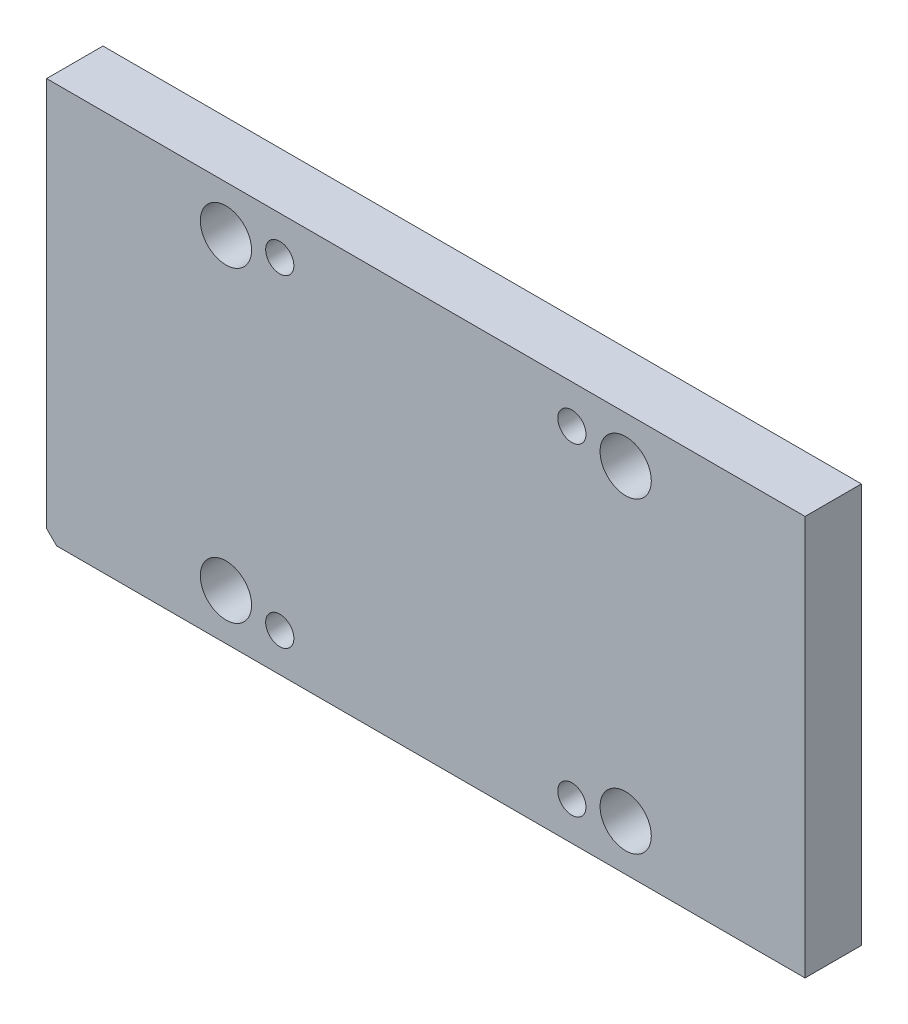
ISO-10303-21;
HEADER;
FILE_DESCRIPTION(('STEP AP214'),'2;1');
FILE_NAME('part.step','',(''),(''),'','','');
FILE_SCHEMA(('AUTOMOTIVE_DESIGN { 1 0 10303 214 1 1 1 1 }'));
ENDSEC;
DATA;
#1=APPLICATION_CONTEXT('core data for automotive mechanical design processes');
#2=APPLICATION_PROTOCOL_DEFINITION('international standard','automotive_design',2000,#1);
#3=PRODUCT_CONTEXT('',#1,'mechanical');
#4=PRODUCT('Part','Part','',(#3));
#5=PRODUCT_RELATED_PRODUCT_CATEGORY('part','',(#4));
#6=PRODUCT_DEFINITION_FORMATION('','',#4);
#7=PRODUCT_DEFINITION_CONTEXT('part definition',#1,'design');
#8=PRODUCT_DEFINITION('design','',#6,#7);
#9=PRODUCT_DEFINITION_SHAPE('','',#8);
#10=(LENGTH_UNIT() NAMED_UNIT(*) SI_UNIT(.MILLI.,.METRE.));
#11=(NAMED_UNIT(*) PLANE_ANGLE_UNIT() SI_UNIT($,.RADIAN.));
#12=(NAMED_UNIT(*) SI_UNIT($,.STERADIAN.) SOLID_ANGLE_UNIT());
#13=UNCERTAINTY_MEASURE_WITH_UNIT(LENGTH_MEASURE(1.E-05),#10,'distance_accuracy_value','');
#14=(GEOMETRIC_REPRESENTATION_CONTEXT(3) GLOBAL_UNCERTAINTY_ASSIGNED_CONTEXT((#13)) GLOBAL_UNIT_ASSIGNED_CONTEXT((#10,
#11,#12)) REPRESENTATION_CONTEXT('',''));
#15=CARTESIAN_POINT('',(0.,0.,0.));
#16=DIRECTION('',(0.,0.,1.));
#17=DIRECTION('',(1.,0.,0.));
#18=AXIS2_PLACEMENT_3D('',#15,#16,#17);
#19=CARTESIAN_POINT('',(-148.,-78.,-356.592289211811));
#20=DIRECTION('',(-1.,0.,0.));
#21=DIRECTION('',(0.,0.,1.));
#22=AXIS2_PLACEMENT_3D('',#19,#20,#21);
#23=PLANE('',#22);
#24=DIRECTION('',(0.,1.,0.));
#25=VECTOR('',#24,1.);
#26=CARTESIAN_POINT('',(-148.,-78.,-22.));
#27=LINE('',#26,#25);
#28=CARTESIAN_POINT('',(-148.,-74.08,-22.));
#29=VERTEX_POINT('',#28);
#30=CARTESIAN_POINT('',(-148.,78.,-22.));
#31=VERTEX_POINT('',#30);
#32=EDGE_CURVE('E108',#29,#31,#27,.T.);
#33=ORIENTED_EDGE('',*,*,#32,.F.);
#34=DIRECTION('',(0.,0.,1.));
#35=VECTOR('',#34,1.);
#36=CARTESIAN_POINT('',(-148.,-74.08,-356.592289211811));
#37=LINE('',#36,#35);
#38=CARTESIAN_POINT('',(-148.,-74.08,0.));
#39=VERTEX_POINT('',#38);
#40=EDGE_CURVE('E107',#29,#39,#37,.T.);
#41=ORIENTED_EDGE('',*,*,#40,.T.);
#42=DIRECTION('',(0.,-1.,0.));
#43=VECTOR('',#42,1.);
#44=CARTESIAN_POINT('',(-148.,-78.,0.));
#45=LINE('',#44,#43);
#46=CARTESIAN_POINT('',(-148.,78.,0.));
#47=VERTEX_POINT('',#46);
#48=EDGE_CURVE('E85',#47,#39,#45,.T.);
#49=ORIENTED_EDGE('',*,*,#48,.F.);
#50=DIRECTION('',(0.,0.,1.));
#51=VECTOR('',#50,1.);
#52=CARTESIAN_POINT('',(-148.,78.,-356.592289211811));
#53=LINE('',#52,#51);
#54=EDGE_CURVE('E102',#31,#47,#53,.T.);
#55=ORIENTED_EDGE('',*,*,#54,.F.);
#56=EDGE_LOOP('',(#33,#41,#49,#55));
#57=FACE_BOUND('',#56,.T.);
#58=ADVANCED_FACE('F34',(#57),#23,.T.);
#59=CARTESIAN_POINT('',(-148.,78.,-356.592289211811));
#60=DIRECTION('',(0.,1.,0.));
#61=DIRECTION('',(0.,0.,1.));
#62=AXIS2_PLACEMENT_3D('',#59,#60,#61);
#63=PLANE('',#62);
#64=DIRECTION('',(1.,0.,0.));
#65=VECTOR('',#64,1.);
#66=CARTESIAN_POINT('',(-148.,78.,-22.));
#67=LINE('',#66,#65);
#68=CARTESIAN_POINT('',(148.,78.,-22.));
#69=VERTEX_POINT('',#68);
#70=EDGE_CURVE('E124',#31,#69,#67,.T.);
#71=ORIENTED_EDGE('',*,*,#70,.F.);
#72=ORIENTED_EDGE('',*,*,#54,.T.);
#73=DIRECTION('',(-1.,0.,0.));
#74=VECTOR('',#73,1.);
#75=CARTESIAN_POINT('',(-148.,78.,0.));
#76=LINE('',#75,#74);
#77=CARTESIAN_POINT('',(148.,78.,0.));
#78=VERTEX_POINT('',#77);
#79=EDGE_CURVE('E94',#78,#47,#76,.T.);
#80=ORIENTED_EDGE('',*,*,#79,.F.);
#81=DIRECTION('',(0.,0.,1.));
#82=VECTOR('',#81,1.);
#83=CARTESIAN_POINT('',(148.,78.,-356.592289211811));
#84=LINE('',#83,#82);
#85=EDGE_CURVE('E93',#69,#78,#84,.T.);
#86=ORIENTED_EDGE('',*,*,#85,.F.);
#87=EDGE_LOOP('',(#71,#72,#80,#86));
#88=FACE_BOUND('',#87,.T.);
#89=ADVANCED_FACE('F215',(#88),#63,.T.);
#90=CARTESIAN_POINT('',(148.,-78.,-356.592289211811));
#91=DIRECTION('',(1.,0.,0.));
#92=DIRECTION('',(0.,1.,0.));
#93=AXIS2_PLACEMENT_3D('',#90,#91,#92);
#94=PLANE('',#93);
#95=DIRECTION('',(0.,-1.,0.));
#96=VECTOR('',#95,1.);
#97=CARTESIAN_POINT('',(148.,-78.,-22.));
#98=LINE('',#97,#96);
#99=CARTESIAN_POINT('',(148.,-78.,-22.0000000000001));
#100=VERTEX_POINT('',#99);
#101=EDGE_CURVE('E104',#69,#100,#98,.T.);
#102=ORIENTED_EDGE('',*,*,#101,.F.);
#103=ORIENTED_EDGE('',*,*,#85,.T.);
#104=DIRECTION('',(0.,1.,0.));
#105=VECTOR('',#104,1.);
#106=CARTESIAN_POINT('',(148.,-78.,0.));
#107=LINE('',#106,#105);
#108=CARTESIAN_POINT('',(148.,-78.,0.));
#109=VERTEX_POINT('',#108);
#110=EDGE_CURVE('E83',#109,#78,#107,.T.);
#111=ORIENTED_EDGE('',*,*,#110,.F.);
#112=DIRECTION('',(0.,0.,1.));
#113=VECTOR('',#112,1.);
#114=CARTESIAN_POINT('',(148.,-78.,-356.592289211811));
#115=LINE('',#114,#113);
#116=EDGE_CURVE('E88',#100,#109,#115,.T.);
#117=ORIENTED_EDGE('',*,*,#116,.F.);
#118=EDGE_LOOP('',(#102,#103,#111,#117));
#119=FACE_BOUND('',#118,.T.);
#120=ADVANCED_FACE('F96',(#119),#94,.T.);
#121=CARTESIAN_POINT('',(-148.,-78.,-356.592289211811));
#122=DIRECTION('',(0.,-1.,0.));
#123=DIRECTION('',(1.,0.,0.));
#124=AXIS2_PLACEMENT_3D('',#121,#122,#123);
#125=PLANE('',#124);
#126=DIRECTION('',(1.,0.,0.));
#127=VECTOR('',#126,1.);
#128=CARTESIAN_POINT('',(-148.,-78.,0.));
#129=LINE('',#128,#127);
#130=CARTESIAN_POINT('',(-144.08,-78.,0.));
#131=VERTEX_POINT('',#130);
#132=EDGE_CURVE('E78',#131,#109,#129,.T.);
#133=ORIENTED_EDGE('',*,*,#132,.F.);
#134=DIRECTION('',(0.,0.,-1.));
#135=VECTOR('',#134,1.);
#136=CARTESIAN_POINT('',(-144.08,-78.,-356.592289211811));
#137=LINE('',#136,#135);
#138=CARTESIAN_POINT('',(-144.08,-78.,-22.));
#139=VERTEX_POINT('',#138);
#140=EDGE_CURVE('E42',#131,#139,#137,.T.);
#141=ORIENTED_EDGE('',*,*,#140,.T.);
#142=DIRECTION('',(-1.,0.,0.));
#143=VECTOR('',#142,1.);
#144=CARTESIAN_POINT('',(-148.,-78.,-22.));
#145=LINE('',#144,#143);
#146=EDGE_CURVE('E90',#100,#139,#145,.T.);
#147=ORIENTED_EDGE('',*,*,#146,.F.);
#148=ORIENTED_EDGE('',*,*,#116,.T.);
#149=EDGE_LOOP('',(#133,#141,#147,#148));
#150=FACE_BOUND('',#149,.T.);
#151=ADVANCED_FACE('F89',(#150),#125,.T.);
#152=CARTESIAN_POINT('',(0.,0.,0.));
#153=DIRECTION('',(0.,0.,-1.));
#154=DIRECTION('',(-1.,0.,0.));
#155=AXIS2_PLACEMENT_3D('',#152,#153,#154);
#156=PLANE('',#155);
#157=CARTESIAN_POINT('',(-57.,-63.,0.));
#158=DIRECTION('',(0.,0.,-1.));
#159=DIRECTION('',(-1.,0.,0.));
#160=AXIS2_PLACEMENT_3D('',#157,#158,#159);
#161=CIRCLE('',#160,5.5);
#162=CARTESIAN_POINT('',(-62.5,-63.,0.));
#163=VERTEX_POINT('',#162);
#164=EDGE_CURVE('E183',#163,#163,#161,.T.);
#165=ORIENTED_EDGE('',*,*,#164,.T.);
#166=EDGE_LOOP('',(#165));
#167=FACE_BOUND('',#166,.T.);
#168=CARTESIAN_POINT('',(-57.,63.,0.));
#169=DIRECTION('',(0.,0.,-1.));
#170=DIRECTION('',(-1.,0.,0.));
#171=AXIS2_PLACEMENT_3D('',#168,#169,#170);
#172=CIRCLE('',#171,5.5);
#173=CARTESIAN_POINT('',(-62.5,63.,0.));
#174=VERTEX_POINT('',#173);
#175=EDGE_CURVE('E171',#174,#174,#172,.T.);
#176=ORIENTED_EDGE('',*,*,#175,.T.);
#177=EDGE_LOOP('',(#176));
#178=FACE_BOUND('',#177,.T.);
#179=CARTESIAN_POINT('',(57.,63.,0.));
#180=DIRECTION('',(0.,0.,-1.));
#181=DIRECTION('',(-1.,0.,0.));
#182=AXIS2_PLACEMENT_3D('',#179,#180,#181);
#183=CIRCLE('',#182,5.50000000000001);
#184=CARTESIAN_POINT('',(51.5,63.,0.));
#185=VERTEX_POINT('',#184);
#186=EDGE_CURVE('E159',#185,#185,#183,.T.);
#187=ORIENTED_EDGE('',*,*,#186,.T.);
#188=EDGE_LOOP('',(#187));
#189=FACE_BOUND('',#188,.T.);
#190=CARTESIAN_POINT('',(57.0000000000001,-63.,0.));
#191=DIRECTION('',(0.,0.,-1.));
#192=DIRECTION('',(-1.,0.,0.));
#193=AXIS2_PLACEMENT_3D('',#190,#191,#192);
#194=CIRCLE('',#193,5.50000000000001);
#195=CARTESIAN_POINT('',(51.5000000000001,-63.,0.));
#196=VERTEX_POINT('',#195);
#197=EDGE_CURVE('E147',#196,#196,#194,.T.);
#198=ORIENTED_EDGE('',*,*,#197,.T.);
#199=EDGE_LOOP('',(#198));
#200=FACE_BOUND('',#199,.T.);
#201=CARTESIAN_POINT('',(-78.,-60.,0.));
#202=DIRECTION('',(0.,0.,1.));
#203=DIRECTION('',(1.,0.,0.));
#204=AXIS2_PLACEMENT_3D('',#201,#202,#203);
#205=CIRCLE('',#204,9.99999999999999);
#206=CARTESIAN_POINT('',(-68.,-60.,0.));
#207=VERTEX_POINT('',#206);
#208=EDGE_CURVE('E144',#207,#207,#205,.T.);
#209=ORIENTED_EDGE('',*,*,#208,.F.);
#210=EDGE_LOOP('',(#209));
#211=FACE_BOUND('',#210,.T.);
#212=CARTESIAN_POINT('',(-78.,60.,0.));
#213=DIRECTION('',(0.,0.,1.));
#214=DIRECTION('',(1.,0.,0.));
#215=AXIS2_PLACEMENT_3D('',#212,#213,#214);
#216=CIRCLE('',#215,9.99999999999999);
#217=CARTESIAN_POINT('',(-68.,60.,0.));
#218=VERTEX_POINT('',#217);
#219=EDGE_CURVE('E138',#218,#218,#216,.T.);
#220=ORIENTED_EDGE('',*,*,#219,.F.);
#221=EDGE_LOOP('',(#220));
#222=FACE_BOUND('',#221,.T.);
#223=CARTESIAN_POINT('',(78.,60.,0.));
#224=DIRECTION('',(0.,0.,1.));
#225=DIRECTION('',(1.,0.,0.));
#226=AXIS2_PLACEMENT_3D('',#223,#224,#225);
#227=CIRCLE('',#226,9.99999999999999);
#228=CARTESIAN_POINT('',(88.,60.,0.));
#229=VERTEX_POINT('',#228);
#230=EDGE_CURVE('E132',#229,#229,#227,.T.);
#231=ORIENTED_EDGE('',*,*,#230,.F.);
#232=EDGE_LOOP('',(#231));
#233=FACE_BOUND('',#232,.T.);
#234=CARTESIAN_POINT('',(78.,-60.,0.));
#235=DIRECTION('',(0.,0.,1.));
#236=DIRECTION('',(1.,0.,0.));
#237=AXIS2_PLACEMENT_3D('',#234,#235,#236);
#238=CIRCLE('',#237,9.99999999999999);
#239=CARTESIAN_POINT('',(88.,-60.,0.));
#240=VERTEX_POINT('',#239);
#241=EDGE_CURVE('E120',#240,#240,#238,.T.);
#242=ORIENTED_EDGE('',*,*,#241,.F.);
#243=EDGE_LOOP('',(#242));
#244=FACE_BOUND('',#243,.T.);
#245=ORIENTED_EDGE('',*,*,#48,.T.);
#246=DIRECTION('',(-0.70710678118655,0.707106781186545,0.));
#247=VECTOR('',#246,1.);
#248=CARTESIAN_POINT('',(-148.,-74.08,0.));
#249=LINE('',#248,#247);
#250=EDGE_CURVE('E56',#39,#131,#249,.F.);
#251=ORIENTED_EDGE('',*,*,#250,.T.);
#252=ORIENTED_EDGE('',*,*,#132,.T.);
#253=ORIENTED_EDGE('',*,*,#110,.T.);
#254=ORIENTED_EDGE('',*,*,#79,.T.);
#255=EDGE_LOOP('',(#245,#251,#252,#253,#254));
#256=FACE_BOUND('',#255,.T.);
#257=ADVANCED_FACE('F80',(#167,#178,#189,#200,#211,#222,#233,#244,#256),#156,.F.);
#258=CARTESIAN_POINT('',(0.,0.,-22.));
#259=DIRECTION('',(0.,0.,1.));
#260=DIRECTION('',(1.,0.,0.));
#261=AXIS2_PLACEMENT_3D('',#258,#259,#260);
#262=PLANE('',#261);
#263=CARTESIAN_POINT('',(0.,0.,-22.));
#264=DIRECTION('',(0.,0.,1.));
#265=DIRECTION('',(1.,0.,0.));
#266=AXIS2_PLACEMENT_3D('',#263,#264,#265);
#267=CIRCLE('',#266,45.);
#268=CARTESIAN_POINT('',(45.,0.,-22.));
#269=VERTEX_POINT('',#268);
#270=EDGE_CURVE('E196',#269,#269,#267,.T.);
#271=ORIENTED_EDGE('',*,*,#270,.T.);
#272=EDGE_LOOP('',(#271));
#273=FACE_BOUND('',#272,.T.);
#274=CARTESIAN_POINT('',(-57.,-63.,-22.));
#275=DIRECTION('',(0.,0.,-1.));
#276=DIRECTION('',(-1.,0.,0.));
#277=AXIS2_PLACEMENT_3D('',#274,#275,#276);
#278=CIRCLE('',#277,9.);
#279=CARTESIAN_POINT('',(-66.,-63.,-22.));
#280=VERTEX_POINT('',#279);
#281=EDGE_CURVE('E192',#280,#280,#278,.T.);
#282=ORIENTED_EDGE('',*,*,#281,.F.);
#283=EDGE_LOOP('',(#282));
#284=FACE_BOUND('',#283,.T.);
#285=CARTESIAN_POINT('',(-57.,63.,-22.));
#286=DIRECTION('',(0.,0.,-1.));
#287=DIRECTION('',(-1.,0.,0.));
#288=AXIS2_PLACEMENT_3D('',#285,#286,#287);
#289=CIRCLE('',#288,9.);
#290=CARTESIAN_POINT('',(-66.,63.,-22.));
#291=VERTEX_POINT('',#290);
#292=EDGE_CURVE('E180',#291,#291,#289,.T.);
#293=ORIENTED_EDGE('',*,*,#292,.F.);
#294=EDGE_LOOP('',(#293));
#295=FACE_BOUND('',#294,.T.);
#296=CARTESIAN_POINT('',(57.,63.,-22.));
#297=DIRECTION('',(0.,0.,-1.));
#298=DIRECTION('',(-1.,0.,0.));
#299=AXIS2_PLACEMENT_3D('',#296,#297,#298);
#300=CIRCLE('',#299,9.00000000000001);
#301=CARTESIAN_POINT('',(48.,63.,-22.));
#302=VERTEX_POINT('',#301);
#303=EDGE_CURVE('E168',#302,#302,#300,.T.);
#304=ORIENTED_EDGE('',*,*,#303,.F.);
#305=EDGE_LOOP('',(#304));
#306=FACE_BOUND('',#305,.T.);
#307=CARTESIAN_POINT('',(57.0000000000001,-63.,-22.));
#308=DIRECTION('',(0.,0.,-1.));
#309=DIRECTION('',(-1.,0.,0.));
#310=AXIS2_PLACEMENT_3D('',#307,#308,#309);
#311=CIRCLE('',#310,9.00000000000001);
#312=CARTESIAN_POINT('',(48.0000000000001,-63.,-22.));
#313=VERTEX_POINT('',#312);
#314=EDGE_CURVE('E156',#313,#313,#311,.T.);
#315=ORIENTED_EDGE('',*,*,#314,.F.);
#316=EDGE_LOOP('',(#315));
#317=FACE_BOUND('',#316,.T.);
#318=CARTESIAN_POINT('',(-78.,-60.,-22.));
#319=DIRECTION('',(0.,0.,1.));
#320=DIRECTION('',(1.,0.,0.));
#321=AXIS2_PLACEMENT_3D('',#318,#319,#320);
#322=CIRCLE('',#321,9.99999999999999);
#323=CARTESIAN_POINT('',(-68.,-60.,-22.));
#324=VERTEX_POINT('',#323);
#325=EDGE_CURVE('E141',#324,#324,#322,.T.);
#326=ORIENTED_EDGE('',*,*,#325,.T.);
#327=EDGE_LOOP('',(#326));
#328=FACE_BOUND('',#327,.T.);
#329=CARTESIAN_POINT('',(-78.,60.,-22.));
#330=DIRECTION('',(0.,0.,1.));
#331=DIRECTION('',(1.,0.,0.));
#332=AXIS2_PLACEMENT_3D('',#329,#330,#331);
#333=CIRCLE('',#332,9.99999999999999);
#334=CARTESIAN_POINT('',(-68.,60.,-22.));
#335=VERTEX_POINT('',#334);
#336=EDGE_CURVE('E135',#335,#335,#333,.T.);
#337=ORIENTED_EDGE('',*,*,#336,.T.);
#338=EDGE_LOOP('',(#337));
#339=FACE_BOUND('',#338,.T.);
#340=CARTESIAN_POINT('',(78.,60.,-22.));
#341=DIRECTION('',(0.,0.,1.));
#342=DIRECTION('',(1.,0.,0.));
#343=AXIS2_PLACEMENT_3D('',#340,#341,#342);
#344=CIRCLE('',#343,9.99999999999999);
#345=CARTESIAN_POINT('',(88.,60.,-22.));
#346=VERTEX_POINT('',#345);
#347=EDGE_CURVE('E129',#346,#346,#344,.T.);
#348=ORIENTED_EDGE('',*,*,#347,.T.);
#349=EDGE_LOOP('',(#348));
#350=FACE_BOUND('',#349,.T.);
#351=CARTESIAN_POINT('',(78.,-60.,-22.));
#352=DIRECTION('',(0.,0.,1.));
#353=DIRECTION('',(1.,0.,0.));
#354=AXIS2_PLACEMENT_3D('',#351,#352,#353);
#355=CIRCLE('',#354,9.99999999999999);
#356=CARTESIAN_POINT('',(88.,-60.,-22.));
#357=VERTEX_POINT('',#356);
#358=EDGE_CURVE('E118',#357,#357,#355,.T.);
#359=ORIENTED_EDGE('',*,*,#358,.T.);
#360=EDGE_LOOP('',(#359));
#361=FACE_BOUND('',#360,.T.);
#362=ORIENTED_EDGE('',*,*,#146,.T.);
#363=DIRECTION('',(0.70710678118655,-0.707106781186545,0.));
#364=VECTOR('',#363,1.);
#365=CARTESIAN_POINT('',(-148.,-74.08,-22.));
#366=LINE('',#365,#364);
#367=EDGE_CURVE('E11',#139,#29,#366,.F.);
#368=ORIENTED_EDGE('',*,*,#367,.T.);
#369=ORIENTED_EDGE('',*,*,#32,.T.);
#370=ORIENTED_EDGE('',*,*,#70,.T.);
#371=ORIENTED_EDGE('',*,*,#101,.T.);
#372=EDGE_LOOP('',(#362,#368,#369,#370,#371));
#373=FACE_BOUND('',#372,.T.);
#374=ADVANCED_FACE('F228',(#273,#284,#295,#306,#317,#328,#339,#350,#361,#373),#262,.F.);
#375=CARTESIAN_POINT('',(78.,-60.,0.));
#376=DIRECTION('',(0.,0.,1.));
#377=DIRECTION('',(1.,0.,0.));
#378=AXIS2_PLACEMENT_3D('',#375,#376,#377);
#379=CYLINDRICAL_SURFACE('',#378,9.99999999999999);
#380=ORIENTED_EDGE('',*,*,#358,.F.);
#381=EDGE_LOOP('',(#380));
#382=FACE_BOUND('',#381,.T.);
#383=ORIENTED_EDGE('',*,*,#241,.T.);
#384=EDGE_LOOP('',(#383));
#385=FACE_BOUND('',#384,.T.);
#386=ADVANCED_FACE('F232',(#382,#385),#379,.F.);
#387=CARTESIAN_POINT('',(78.,60.,0.));
#388=DIRECTION('',(0.,0.,1.));
#389=DIRECTION('',(1.,0.,0.));
#390=AXIS2_PLACEMENT_3D('',#387,#388,#389);
#391=CYLINDRICAL_SURFACE('',#390,9.99999999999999);
#392=ORIENTED_EDGE('',*,*,#347,.F.);
#393=EDGE_LOOP('',(#392));
#394=FACE_BOUND('',#393,.T.);
#395=ORIENTED_EDGE('',*,*,#230,.T.);
#396=EDGE_LOOP('',(#395));
#397=FACE_BOUND('',#396,.T.);
#398=ADVANCED_FACE('F236',(#394,#397),#391,.F.);
#399=CARTESIAN_POINT('',(-78.,60.,0.));
#400=DIRECTION('',(0.,0.,1.));
#401=DIRECTION('',(1.,0.,0.));
#402=AXIS2_PLACEMENT_3D('',#399,#400,#401);
#403=CYLINDRICAL_SURFACE('',#402,9.99999999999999);
#404=ORIENTED_EDGE('',*,*,#336,.F.);
#405=EDGE_LOOP('',(#404));
#406=FACE_BOUND('',#405,.T.);
#407=ORIENTED_EDGE('',*,*,#219,.T.);
#408=EDGE_LOOP('',(#407));
#409=FACE_BOUND('',#408,.T.);
#410=ADVANCED_FACE('F240',(#406,#409),#403,.F.);
#411=CARTESIAN_POINT('',(-78.,-60.,0.));
#412=DIRECTION('',(0.,0.,1.));
#413=DIRECTION('',(1.,0.,0.));
#414=AXIS2_PLACEMENT_3D('',#411,#412,#413);
#415=CYLINDRICAL_SURFACE('',#414,9.99999999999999);
#416=ORIENTED_EDGE('',*,*,#325,.F.);
#417=EDGE_LOOP('',(#416));
#418=FACE_BOUND('',#417,.T.);
#419=ORIENTED_EDGE('',*,*,#208,.T.);
#420=EDGE_LOOP('',(#419));
#421=FACE_BOUND('',#420,.T.);
#422=ADVANCED_FACE('F244',(#418,#421),#415,.F.);
#423=CARTESIAN_POINT('',(57.0000000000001,-63.,-22.));
#424=DIRECTION('',(0.,0.,-1.));
#425=DIRECTION('',(-1.,0.,0.));
#426=AXIS2_PLACEMENT_3D('',#423,#424,#425);
#427=CYLINDRICAL_SURFACE('',#426,5.50000000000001);
#428=ORIENTED_EDGE('',*,*,#197,.F.);
#429=EDGE_LOOP('',(#428));
#430=FACE_BOUND('',#429,.T.);
#431=CARTESIAN_POINT('',(57.0000000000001,-63.,-9.));
#432=DIRECTION('',(0.,0.,-1.));
#433=DIRECTION('',(-1.,0.,0.));
#434=AXIS2_PLACEMENT_3D('',#431,#432,#433);
#435=CIRCLE('',#434,5.50000000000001);
#436=CARTESIAN_POINT('',(51.5000000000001,-63.,-9.));
#437=VERTEX_POINT('',#436);
#438=EDGE_CURVE('E150',#437,#437,#435,.T.);
#439=ORIENTED_EDGE('',*,*,#438,.T.);
#440=EDGE_LOOP('',(#439));
#441=FACE_BOUND('',#440,.T.);
#442=ADVANCED_FACE('F248',(#430,#441),#427,.F.);
#443=CARTESIAN_POINT('',(62.5000000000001,-63.,-9.));
#444=DIRECTION('',(0.,0.,1.));
#445=DIRECTION('',(1.,0.,0.));
#446=AXIS2_PLACEMENT_3D('',#443,#444,#445);
#447=PLANE('',#446);
#448=ORIENTED_EDGE('',*,*,#438,.F.);
#449=EDGE_LOOP('',(#448));
#450=FACE_BOUND('',#449,.T.);
#451=CARTESIAN_POINT('',(57.0000000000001,-63.,-9.));
#452=DIRECTION('',(0.,0.,-1.));
#453=DIRECTION('',(-1.,0.,0.));
#454=AXIS2_PLACEMENT_3D('',#451,#452,#453);
#455=CIRCLE('',#454,8.99999999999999);
#456=CARTESIAN_POINT('',(48.0000000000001,-63.,-9.));
#457=VERTEX_POINT('',#456);
#458=EDGE_CURVE('E153',#457,#457,#455,.T.);
#459=ORIENTED_EDGE('',*,*,#458,.T.);
#460=EDGE_LOOP('',(#459));
#461=FACE_BOUND('',#460,.T.);
#462=ADVANCED_FACE('F252',(#450,#461),#447,.F.);
#463=CARTESIAN_POINT('',(57.0000000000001,-63.,-22.));
#464=DIRECTION('',(0.,0.,-1.));
#465=DIRECTION('',(-1.,0.,0.));
#466=AXIS2_PLACEMENT_3D('',#463,#464,#465);
#467=CYLINDRICAL_SURFACE('',#466,9.);
#468=ORIENTED_EDGE('',*,*,#458,.F.);
#469=EDGE_LOOP('',(#468));
#470=FACE_BOUND('',#469,.T.);
#471=ORIENTED_EDGE('',*,*,#314,.T.);
#472=EDGE_LOOP('',(#471));
#473=FACE_BOUND('',#472,.T.);
#474=ADVANCED_FACE('F256',(#470,#473),#467,.F.);
#475=CARTESIAN_POINT('',(57.,63.,-22.));
#476=DIRECTION('',(0.,0.,-1.));
#477=DIRECTION('',(-1.,0.,0.));
#478=AXIS2_PLACEMENT_3D('',#475,#476,#477);
#479=CYLINDRICAL_SURFACE('',#478,5.50000000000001);
#480=ORIENTED_EDGE('',*,*,#186,.F.);
#481=EDGE_LOOP('',(#480));
#482=FACE_BOUND('',#481,.T.);
#483=CARTESIAN_POINT('',(57.,63.,-9.));
#484=DIRECTION('',(0.,0.,-1.));
#485=DIRECTION('',(-1.,0.,0.));
#486=AXIS2_PLACEMENT_3D('',#483,#484,#485);
#487=CIRCLE('',#486,5.50000000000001);
#488=CARTESIAN_POINT('',(51.5,63.,-9.));
#489=VERTEX_POINT('',#488);
#490=EDGE_CURVE('E162',#489,#489,#487,.T.);
#491=ORIENTED_EDGE('',*,*,#490,.T.);
#492=EDGE_LOOP('',(#491));
#493=FACE_BOUND('',#492,.T.);
#494=ADVANCED_FACE('F260',(#482,#493),#479,.F.);
#495=CARTESIAN_POINT('',(62.5,63.,-9.));
#496=DIRECTION('',(0.,0.,1.));
#497=DIRECTION('',(1.,0.,0.));
#498=AXIS2_PLACEMENT_3D('',#495,#496,#497);
#499=PLANE('',#498);
#500=ORIENTED_EDGE('',*,*,#490,.F.);
#501=EDGE_LOOP('',(#500));
#502=FACE_BOUND('',#501,.T.);
#503=CARTESIAN_POINT('',(57.,63.,-9.));
#504=DIRECTION('',(0.,0.,-1.));
#505=DIRECTION('',(-1.,0.,0.));
#506=AXIS2_PLACEMENT_3D('',#503,#504,#505);
#507=CIRCLE('',#506,9.00000000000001);
#508=CARTESIAN_POINT('',(48.,63.,-9.));
#509=VERTEX_POINT('',#508);
#510=EDGE_CURVE('E165',#509,#509,#507,.T.);
#511=ORIENTED_EDGE('',*,*,#510,.T.);
#512=EDGE_LOOP('',(#511));
#513=FACE_BOUND('',#512,.T.);
#514=ADVANCED_FACE('F264',(#502,#513),#499,.F.);
#515=CARTESIAN_POINT('',(57.,63.,-22.));
#516=DIRECTION('',(0.,0.,-1.));
#517=DIRECTION('',(-1.,0.,0.));
#518=AXIS2_PLACEMENT_3D('',#515,#516,#517);
#519=CYLINDRICAL_SURFACE('',#518,9.00000000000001);
#520=ORIENTED_EDGE('',*,*,#510,.F.);
#521=EDGE_LOOP('',(#520));
#522=FACE_BOUND('',#521,.T.);
#523=ORIENTED_EDGE('',*,*,#303,.T.);
#524=EDGE_LOOP('',(#523));
#525=FACE_BOUND('',#524,.T.);
#526=ADVANCED_FACE('F268',(#522,#525),#519,.F.);
#527=CARTESIAN_POINT('',(-57.,63.,-22.));
#528=DIRECTION('',(0.,0.,-1.));
#529=DIRECTION('',(-1.,0.,0.));
#530=AXIS2_PLACEMENT_3D('',#527,#528,#529);
#531=CYLINDRICAL_SURFACE('',#530,5.5);
#532=ORIENTED_EDGE('',*,*,#175,.F.);
#533=EDGE_LOOP('',(#532));
#534=FACE_BOUND('',#533,.T.);
#535=CARTESIAN_POINT('',(-57.,63.,-9.));
#536=DIRECTION('',(0.,0.,-1.));
#537=DIRECTION('',(-1.,0.,0.));
#538=AXIS2_PLACEMENT_3D('',#535,#536,#537);
#539=CIRCLE('',#538,5.5);
#540=CARTESIAN_POINT('',(-62.5,63.,-9.));
#541=VERTEX_POINT('',#540);
#542=EDGE_CURVE('E174',#541,#541,#539,.T.);
#543=ORIENTED_EDGE('',*,*,#542,.T.);
#544=EDGE_LOOP('',(#543));
#545=FACE_BOUND('',#544,.T.);
#546=ADVANCED_FACE('F272',(#534,#545),#531,.F.);
#547=CARTESIAN_POINT('',(-51.5,63.,-9.));
#548=DIRECTION('',(0.,0.,1.));
#549=DIRECTION('',(1.,0.,0.));
#550=AXIS2_PLACEMENT_3D('',#547,#548,#549);
#551=PLANE('',#550);
#552=ORIENTED_EDGE('',*,*,#542,.F.);
#553=EDGE_LOOP('',(#552));
#554=FACE_BOUND('',#553,.T.);
#555=CARTESIAN_POINT('',(-57.,63.,-9.));
#556=DIRECTION('',(0.,0.,-1.));
#557=DIRECTION('',(-1.,0.,0.));
#558=AXIS2_PLACEMENT_3D('',#555,#556,#557);
#559=CIRCLE('',#558,9.);
#560=CARTESIAN_POINT('',(-66.,63.,-9.));
#561=VERTEX_POINT('',#560);
#562=EDGE_CURVE('E177',#561,#561,#559,.T.);
#563=ORIENTED_EDGE('',*,*,#562,.T.);
#564=EDGE_LOOP('',(#563));
#565=FACE_BOUND('',#564,.T.);
#566=ADVANCED_FACE('F276',(#554,#565),#551,.F.);
#567=CARTESIAN_POINT('',(-57.,63.,-22.));
#568=DIRECTION('',(0.,0.,-1.));
#569=DIRECTION('',(-1.,0.,0.));
#570=AXIS2_PLACEMENT_3D('',#567,#568,#569);
#571=CYLINDRICAL_SURFACE('',#570,9.);
#572=ORIENTED_EDGE('',*,*,#562,.F.);
#573=EDGE_LOOP('',(#572));
#574=FACE_BOUND('',#573,.T.);
#575=ORIENTED_EDGE('',*,*,#292,.T.);
#576=EDGE_LOOP('',(#575));
#577=FACE_BOUND('',#576,.T.);
#578=ADVANCED_FACE('F280',(#574,#577),#571,.F.);
#579=CARTESIAN_POINT('',(-57.,-63.,-22.));
#580=DIRECTION('',(0.,0.,-1.));
#581=DIRECTION('',(-1.,0.,0.));
#582=AXIS2_PLACEMENT_3D('',#579,#580,#581);
#583=CYLINDRICAL_SURFACE('',#582,5.5);
#584=ORIENTED_EDGE('',*,*,#164,.F.);
#585=EDGE_LOOP('',(#584));
#586=FACE_BOUND('',#585,.T.);
#587=CARTESIAN_POINT('',(-57.,-63.,-9.));
#588=DIRECTION('',(0.,0.,-1.));
#589=DIRECTION('',(-1.,0.,0.));
#590=AXIS2_PLACEMENT_3D('',#587,#588,#589);
#591=CIRCLE('',#590,5.5);
#592=CARTESIAN_POINT('',(-62.5,-63.,-9.));
#593=VERTEX_POINT('',#592);
#594=EDGE_CURVE('E186',#593,#593,#591,.T.);
#595=ORIENTED_EDGE('',*,*,#594,.T.);
#596=EDGE_LOOP('',(#595));
#597=FACE_BOUND('',#596,.T.);
#598=ADVANCED_FACE('F284',(#586,#597),#583,.F.);
#599=CARTESIAN_POINT('',(-51.5,-63.,-9.));
#600=DIRECTION('',(0.,0.,1.));
#601=DIRECTION('',(1.,0.,0.));
#602=AXIS2_PLACEMENT_3D('',#599,#600,#601);
#603=PLANE('',#602);
#604=ORIENTED_EDGE('',*,*,#594,.F.);
#605=EDGE_LOOP('',(#604));
#606=FACE_BOUND('',#605,.T.);
#607=CARTESIAN_POINT('',(-57.,-63.,-9.));
#608=DIRECTION('',(0.,0.,-1.));
#609=DIRECTION('',(-1.,0.,0.));
#610=AXIS2_PLACEMENT_3D('',#607,#608,#609);
#611=CIRCLE('',#610,9.);
#612=CARTESIAN_POINT('',(-66.,-63.,-9.));
#613=VERTEX_POINT('',#612);
#614=EDGE_CURVE('E189',#613,#613,#611,.T.);
#615=ORIENTED_EDGE('',*,*,#614,.T.);
#616=EDGE_LOOP('',(#615));
#617=FACE_BOUND('',#616,.T.);
#618=ADVANCED_FACE('F288',(#606,#617),#603,.F.);
#619=CARTESIAN_POINT('',(-57.,-63.,-22.));
#620=DIRECTION('',(0.,0.,-1.));
#621=DIRECTION('',(-1.,0.,0.));
#622=AXIS2_PLACEMENT_3D('',#619,#620,#621);
#623=CYLINDRICAL_SURFACE('',#622,9.);
#624=ORIENTED_EDGE('',*,*,#614,.F.);
#625=EDGE_LOOP('',(#624));
#626=FACE_BOUND('',#625,.T.);
#627=ORIENTED_EDGE('',*,*,#281,.T.);
#628=EDGE_LOOP('',(#627));
#629=FACE_BOUND('',#628,.T.);
#630=ADVANCED_FACE('F212',(#626,#629),#623,.F.);
#631=CARTESIAN_POINT('',(0.,0.,-17.95));
#632=DIRECTION('',(0.,0.,-1.));
#633=DIRECTION('',(-1.,0.,0.));
#634=AXIS2_PLACEMENT_3D('',#631,#632,#633);
#635=CYLINDRICAL_SURFACE('',#634,45.);
#636=CARTESIAN_POINT('',(0.,0.,-17.95));
#637=DIRECTION('',(0.,0.,1.));
#638=DIRECTION('',(1.,0.,0.));
#639=AXIS2_PLACEMENT_3D('',#636,#637,#638);
#640=CIRCLE('',#639,45.);
#641=CARTESIAN_POINT('',(45.,0.,-17.95));
#642=VERTEX_POINT('',#641);
#643=EDGE_CURVE('E195',#642,#642,#640,.T.);
#644=ORIENTED_EDGE('',*,*,#643,.T.);
#645=EDGE_LOOP('',(#644));
#646=FACE_BOUND('',#645,.T.);
#647=ORIENTED_EDGE('',*,*,#270,.F.);
#648=EDGE_LOOP('',(#647));
#649=FACE_BOUND('',#648,.T.);
#650=ADVANCED_FACE('F202',(#646,#649),#635,.F.);
#651=CARTESIAN_POINT('',(0.,0.,-17.95));
#652=DIRECTION('',(0.,0.,1.));
#653=DIRECTION('',(1.,0.,0.));
#654=AXIS2_PLACEMENT_3D('',#651,#652,#653);
#655=PLANE('',#654);
#656=ORIENTED_EDGE('',*,*,#643,.F.);
#657=EDGE_LOOP('',(#656));
#658=FACE_BOUND('',#657,.T.);
#659=ADVANCED_FACE('F205',(#658),#655,.F.);
#660=CARTESIAN_POINT('',(-148.,-74.08,-356.592289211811));
#661=DIRECTION('',(0.707106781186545,0.70710678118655,0.));
#662=DIRECTION('',(0.,0.,1.));
#663=AXIS2_PLACEMENT_3D('',#660,#661,#662);
#664=PLANE('',#663);
#665=ORIENTED_EDGE('',*,*,#367,.F.);
#666=ORIENTED_EDGE('',*,*,#140,.F.);
#667=ORIENTED_EDGE('',*,*,#250,.F.);
#668=ORIENTED_EDGE('',*,*,#40,.F.);
#669=EDGE_LOOP('',(#665,#666,#667,#668));
#670=FACE_BOUND('',#669,.T.);
#671=ADVANCED_FACE('F36',(#670),#664,.F.);
#672=CLOSED_SHELL('',(#58,#89,#120,#151,#257,#374,#386,#398,#410,#422,#442,#462,#474,#494,#514,
#526,#546,#566,#578,#598,#618,#630,#650,#659,#671));
#673=MANIFOLD_SOLID_BREP('B2',#672);
#674=ADVANCED_BREP_SHAPE_REPRESENTATION('',(#18,#673),#14);
#675=SHAPE_DEFINITION_REPRESENTATION(#9,#674);
ENDSEC;
END-ISO-10303-21;
